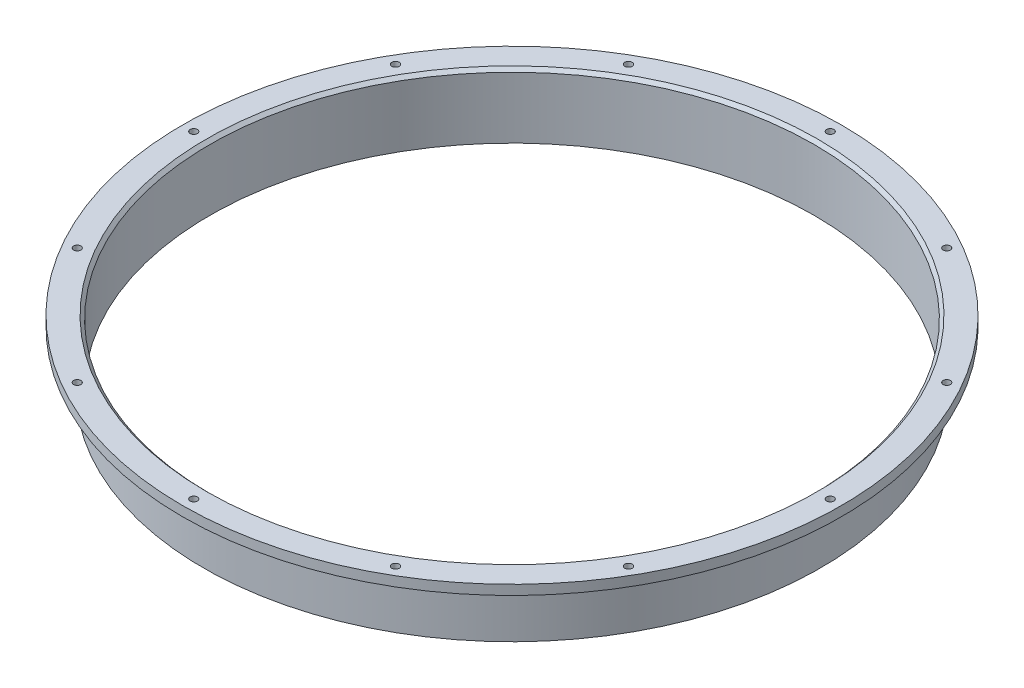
from build123d import *

# Parameters (mm, degrees)
SKETCH1_R          = 323.85
EXTRUDE1_DEPTH     = 63.5
SKETCH2_R          = 296.9895
CUT_EXTRUDE1_DEPTH = 463.3741937
SKETCH3_OUTSIDE_W  = 833.336
SKETCH3_OUTSIDE_H  = 833.336
SKETCH3_OUTSIDE_R  = 303.2125
CUT_EXTRUDE2_DEPTH = 53.975
SKETCH4_R          = 3.5687
CUT_EXTRUDE3_DEPTH = 463.3741937
CIRPATTERN1_COUNT  = 12
CHAMFER1_SIZE      = 3.175


with BuildPart() as part:
    # Sketch1 → Extrude1 (new body)
    with BuildSketch(Plane(origin=(0, 0, 0), x_dir=(1, 0, 0), z_dir=(0, 1, 0))):
        with Locations(Location((0, 0, 0), (0, 0, 270))):
            Circle(SKETCH1_R)
    extrude(amount=-EXTRUDE1_DEPTH)

    # Sketch2 → Cut-Extrude1 (cut, through all)
    with BuildSketch(Plane(origin=(0, 0, 0), x_dir=(-1, 0, 0), z_dir=(0, 1, 0))):
        with Locations(Location((0, 0, 0), (0, 0, 90))):
            Circle(SKETCH2_R)
    extrude(amount=-CUT_EXTRUDE1_DEPTH, mode=Mode.SUBTRACT)

    # Sketch3 outside → Cut-Extrude2 (cut)
    with BuildSketch(Plane.XZ.offset(63.5)):
        Rectangle(SKETCH3_OUTSIDE_W, SKETCH3_OUTSIDE_H)
        with Locations(Location((0, 0, 0), (0, 0, 270))):
            Circle(SKETCH3_OUTSIDE_R, mode=Mode.SUBTRACT)
    extrude(amount=-CUT_EXTRUDE2_DEPTH, mode=Mode.SUBTRACT)

    # Sketch4 → Cut-Extrude3 (cut, through all)
    with BuildSketch(Plane(origin=(0, 0, 0), x_dir=(-1, 0, 0), z_dir=(0, 1, 0))):
        with Locations(Location((0, -312.7248, 0), (0, 0, 90))):
            Circle(SKETCH4_R)
    cut_extrude3 = extrude(amount=-CUT_EXTRUDE3_DEPTH, mode=Mode.SUBTRACT)

    # CirPattern1: Cut-Extrude3 ×12 about axis
    cirpattern1_axis = Axis((0, 0, 0), (0, 1, 0))
    for i in range(1, CIRPATTERN1_COUNT):
        add(cut_extrude3.rotate(cirpattern1_axis, i * 360 / CIRPATTERN1_COUNT), mode=Mode.SUBTRACT)

    # Chamfer1
    chamfer1_edges = [part.edges().sort_by_distance(p)[0] for p in [
        (0, 0, -296.9895),
    ]]
    chamfer(chamfer1_edges, length=CHAMFER1_SIZE)


solid = part.part
